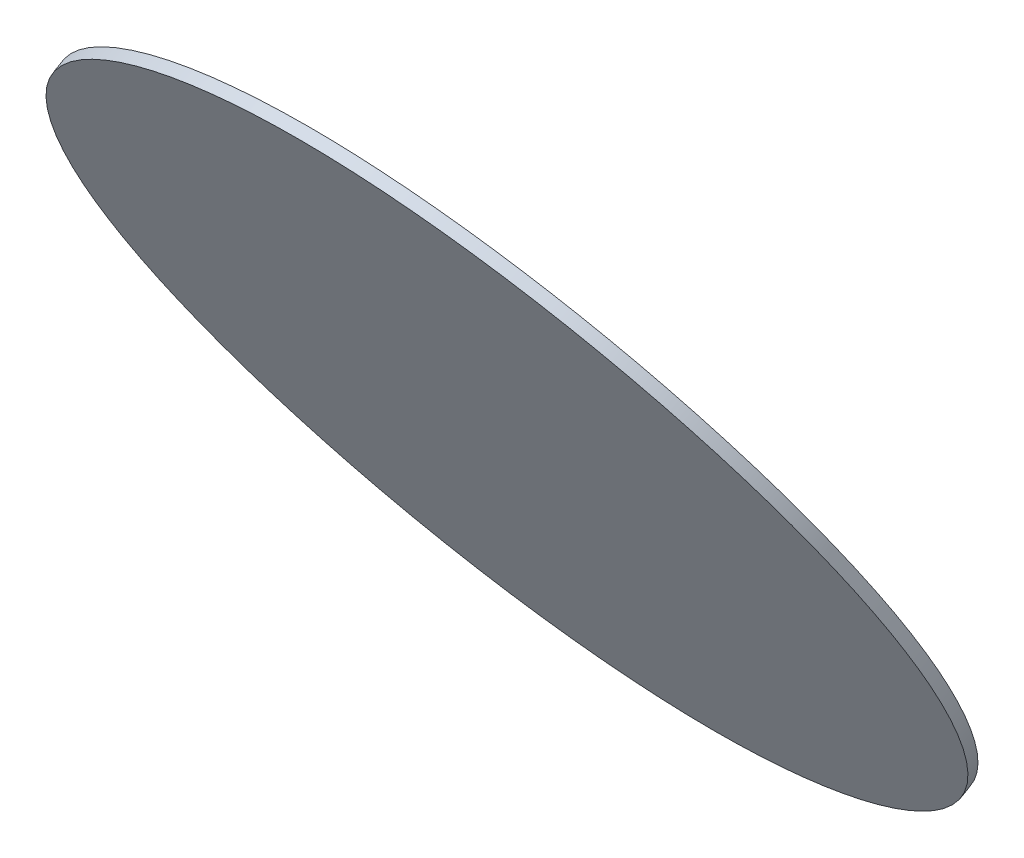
ISO-10303-21;
HEADER;
FILE_DESCRIPTION(('STEP AP214'),'2;1');
FILE_NAME('part.step','',(''),(''),'','','');
FILE_SCHEMA(('AUTOMOTIVE_DESIGN { 1 0 10303 214 1 1 1 1 }'));
ENDSEC;
DATA;
#1=APPLICATION_CONTEXT('core data for automotive mechanical design processes');
#2=APPLICATION_PROTOCOL_DEFINITION('international standard','automotive_design',2000,#1);
#3=PRODUCT_CONTEXT('',#1,'mechanical');
#4=PRODUCT('Part','Part','',(#3));
#5=PRODUCT_RELATED_PRODUCT_CATEGORY('part','',(#4));
#6=PRODUCT_DEFINITION_FORMATION('','',#4);
#7=PRODUCT_DEFINITION_CONTEXT('part definition',#1,'design');
#8=PRODUCT_DEFINITION('design','',#6,#7);
#9=PRODUCT_DEFINITION_SHAPE('','',#8);
#10=(LENGTH_UNIT() NAMED_UNIT(*) SI_UNIT(.MILLI.,.METRE.));
#11=(NAMED_UNIT(*) PLANE_ANGLE_UNIT() SI_UNIT($,.RADIAN.));
#12=(NAMED_UNIT(*) SI_UNIT($,.STERADIAN.) SOLID_ANGLE_UNIT());
#13=UNCERTAINTY_MEASURE_WITH_UNIT(LENGTH_MEASURE(1.E-05),#10,'distance_accuracy_value','');
#14=(GEOMETRIC_REPRESENTATION_CONTEXT(3) GLOBAL_UNCERTAINTY_ASSIGNED_CONTEXT((#13)) GLOBAL_UNIT_ASSIGNED_CONTEXT((#10,
#11,#12)) REPRESENTATION_CONTEXT('',''));
#15=CARTESIAN_POINT('',(0.,0.,0.));
#16=DIRECTION('',(0.,0.,1.));
#17=DIRECTION('',(1.,0.,0.));
#18=AXIS2_PLACEMENT_3D('',#15,#16,#17);
#19=CARTESIAN_POINT('',(-8.17414647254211E-09,26.6680644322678,25.787964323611));
#20=CARTESIAN_POINT('',(-2.08226279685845,26.6683910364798,25.7881528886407));
#21=CARTESIAN_POINT('',(-6.23428150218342,26.3082143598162,25.5802047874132));
#22=CARTESIAN_POINT('',(-12.227366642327,24.7723286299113,24.6934607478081));
#23=CARTESIAN_POINT('',(-17.8169278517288,22.3618821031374,23.301788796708));
#24=CARTESIAN_POINT('',(-22.8866628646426,19.1878807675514,21.4692782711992));
#25=CARTESIAN_POINT('',(-27.319279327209,15.35615582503,19.2570308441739));
#26=CARTESIAN_POINT('',(-30.9945407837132,10.969257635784,16.7242539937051));
#27=CARTESIAN_POINT('',(-33.7883174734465,6.12721648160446,13.9287002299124));
#28=CARTESIAN_POINT('',(-35.5706140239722,0.929267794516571,10.9276631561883));
#29=CARTESIAN_POINT('',(-36.1993788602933,-4.48258185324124,7.80313030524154));
#30=CARTESIAN_POINT('',(-35.5754985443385,-9.89578547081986,4.67781573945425));
#31=CARTESIAN_POINT('',(-33.7935445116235,-15.0963499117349,1.67526845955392));
#32=CARTESIAN_POINT('',(-30.9984057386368,-19.9419825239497,-1.12235883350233));
#33=CARTESIAN_POINT('',(-27.3208649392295,-24.3331863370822,-3.65762153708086));
#34=CARTESIAN_POINT('',(-22.8862683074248,-28.1696493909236,-5.87260451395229));
#35=CARTESIAN_POINT('',(-17.8158973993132,-31.3485354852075,-7.70793525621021));
#36=CARTESIAN_POINT('',(-12.2280640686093,-33.7636357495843,-9.10229404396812));
#37=CARTESIAN_POINT('',(-6.24001970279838,-35.3038642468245,-9.99154538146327));
#38=CARTESIAN_POINT('',(-0.0129368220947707,-35.8473871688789,-10.3053484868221));
#39=CARTESIAN_POINT('',(6.21430999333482,-35.3072480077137,-9.99349899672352));
#40=CARTESIAN_POINT('',(12.2024289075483,-33.7693823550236,-9.10561184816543));
#41=CARTESIAN_POINT('',(17.7904902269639,-31.3566250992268,-7.71260579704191));
#42=CARTESIAN_POINT('',(22.8615880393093,-28.1805374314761,-5.87889072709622));
#43=CARTESIAN_POINT('',(27.2977773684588,-24.3479065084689,-3.66612023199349));
#44=CARTESIAN_POINT('',(30.9781281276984,-19.9620975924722,-1.13397227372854));
#45=CARTESIAN_POINT('',(33.7777710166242,-15.1239325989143,1.65934358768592));
#46=CARTESIAN_POINT('',(35.5660713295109,-9.93336440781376,4.65611953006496));
#47=CARTESIAN_POINT('',(36.1997536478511,-4.53073686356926,7.7753279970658));
#48=CARTESIAN_POINT('',(35.5780125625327,0.873950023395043,10.8957254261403));
#49=CARTESIAN_POINT('',(33.7989997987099,6.06980786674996,13.8955553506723));
#50=CARTESIAN_POINT('',(31.0064459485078,10.9157216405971,16.6933449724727));
#51=CARTESIAN_POINT('',(27.3306578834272,15.3108875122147,19.2308951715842));
#52=CARTESIAN_POINT('',(22.8963726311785,19.153608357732,21.4494910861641));
#53=CARTESIAN_POINT('',(17.8243164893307,22.3396409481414,23.2889478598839));
#54=CARTESIAN_POINT('',(12.2322316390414,24.7612024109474,24.6870370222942));
#55=CARTESIAN_POINT('',(6.23682360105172,26.3060056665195,25.5789295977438));
#56=CARTESIAN_POINT('',(2.08269263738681,26.6677377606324,25.7877757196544));
#57=CARTESIAN_POINT('',(-8.17414647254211E-09,26.6680644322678,25.787964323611));
#58=B_SPLINE_CURVE_WITH_KNOTS('',3,(#19,#20,#21,#22,#23,#24,#25,#26,#27,#28,#29,#30,#31,#32,#33,
#34,#35,#36,#37,#38,#39,#40,#41,#42,#43,#44,#45,#46,#47,#48,#49,#50,#51,#52,#53,#54,#55,#56,
#57),.UNSPECIFIED.,.T.,.F.,(4,1,1,1,1,1,1,1,1,1,1,1,1,1,1,1,1,1,1,1,1,1,1,1,1,1,1,1,1,1,1,1,1,1,
1,1,4),(0.,0.027822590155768,0.0554784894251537,0.0831827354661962,0.11098372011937,
0.138830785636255,0.166641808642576,0.194369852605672,0.222070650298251,0.249969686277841,
0.277871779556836,0.305584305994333,0.333332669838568,0.361169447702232,0.389042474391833,
0.416863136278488,0.444573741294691,0.472215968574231,0.499999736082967,0.527781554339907,
0.555419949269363,0.583126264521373,0.610941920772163,0.63880745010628,0.666631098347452,
0.694356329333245,0.722030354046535,0.749872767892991,0.777720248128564,0.805408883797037,
0.833156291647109,0.861007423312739,0.888903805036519,0.916752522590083,0.944494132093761,
0.972171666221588,1.),.UNSPECIFIED.);
#59=DIRECTION('',(0.,-0.500000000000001,0.866025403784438));
#60=VECTOR('',#59,1.);
#61=SURFACE_OF_LINEAR_EXTRUSION('',#58,#60);
#62=CARTESIAN_POINT('',(2.33694887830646E-08,26.6680644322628,25.7879643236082));
#63=CARTESIAN_POINT('',(-0.467769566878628,26.6681377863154,25.7880066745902));
#64=CARTESIAN_POINT('',(-0.935524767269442,26.6590790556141,25.7827766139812));
#65=CARTESIAN_POINT('',(-1.87015053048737,26.6230155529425,25.7619553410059));
#66=CARTESIAN_POINT('',(-2.33702102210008,26.5960093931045,25.7463633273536));
#67=CARTESIAN_POINT('',(-3.26898583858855,26.5243664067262,25.7050002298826));
#68=CARTESIAN_POINT('',(-3.73408001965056,26.4797281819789,25.6792283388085));
#69=CARTESIAN_POINT('',(-4.66161379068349,26.373140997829,25.6176901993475));
#70=CARTESIAN_POINT('',(-5.12405337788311,26.3111920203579,25.5819239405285));
#71=CARTESIAN_POINT('',(-6.04539567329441,26.170277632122,25.5005669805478));
#72=CARTESIAN_POINT('',(-6.50429884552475,26.0913144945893,25.4549775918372));
#73=CARTESIAN_POINT('',(-7.41780590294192,25.9167632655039,25.3542003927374));
#74=CARTESIAN_POINT('',(-7.87241030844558,25.8211772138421,25.2990137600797));
#75=CARTESIAN_POINT('',(-8.77666909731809,25.6138539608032,25.1793156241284));
#76=CARTESIAN_POINT('',(-9.22632355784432,25.5021170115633,25.1148042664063));
#77=CARTESIAN_POINT('',(-10.1200300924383,25.2629438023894,24.9767175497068));
#78=CARTESIAN_POINT('',(-10.5640821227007,25.1355074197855,24.9031421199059));
#79=CARTESIAN_POINT('',(-11.445931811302,24.8653896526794,24.7471895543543));
#80=CARTESIAN_POINT('',(-11.8837297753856,24.7227090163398,24.6648128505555));
#81=CARTESIAN_POINT('',(-12.7524520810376,24.4225489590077,24.4915153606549));
#82=CARTESIAN_POINT('',(-13.1833771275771,24.2650710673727,24.400595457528));
#83=CARTESIAN_POINT('',(-14.0378495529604,23.9357879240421,24.2104837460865));
#84=CARTESIAN_POINT('',(-14.4613971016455,23.7639830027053,24.1112921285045));
#85=CARTESIAN_POINT('',(-15.3006252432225,23.4065083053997,23.9049040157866));
#86=CARTESIAN_POINT('',(-15.716305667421,23.220838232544,23.797707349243));
#87=CARTESIAN_POINT('',(-16.5393098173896,22.8360953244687,23.5755759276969));
#88=CARTESIAN_POINT('',(-16.9466335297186,22.6370224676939,23.4606411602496));
#89=CARTESIAN_POINT('',(-17.7524394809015,22.2259335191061,23.2232988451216));
#90=CARTESIAN_POINT('',(-18.1509222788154,22.0139182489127,23.1008917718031));
#91=CARTESIAN_POINT('',(-18.9386057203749,21.5773683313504,22.8488495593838));
#92=CARTESIAN_POINT('',(-19.3278068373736,21.352834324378,22.719214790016));
#93=CARTESIAN_POINT('',(-20.0965153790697,20.8916531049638,22.4529516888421));
#94=CARTESIAN_POINT('',(-20.4760228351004,20.6550059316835,22.3163233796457));
#95=CARTESIAN_POINT('',(-21.2249327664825,20.1700041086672,22.0363074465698));
#96=CARTESIAN_POINT('',(-21.5943351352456,19.9216493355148,21.8929197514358));
#97=CARTESIAN_POINT('',(-22.3226250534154,19.4136393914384,21.5996200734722));
#98=CARTESIAN_POINT('',(-22.6815126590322,19.1539842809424,21.4497081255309));
#99=CARTESIAN_POINT('',(-23.3883632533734,18.623766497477,21.143586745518));
#100=CARTESIAN_POINT('',(-23.736326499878,18.3532040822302,20.9873774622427));
#101=CARTESIAN_POINT('',(-24.4209074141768,17.8015274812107,20.6688668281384));
#102=CARTESIAN_POINT('',(-24.7575252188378,17.5204134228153,20.5065655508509));
#103=CARTESIAN_POINT('',(-25.4189998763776,16.947992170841,20.1760779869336));
#104=CARTESIAN_POINT('',(-25.7438567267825,16.656684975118,20.0078916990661));
#105=CARTESIAN_POINT('',(-26.3813919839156,16.064234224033,19.6658400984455));
#106=CARTESIAN_POINT('',(-26.6940702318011,15.76309054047,19.4919747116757));
#107=CARTESIAN_POINT('',(-27.3068335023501,15.1513284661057,19.1387737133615));
#108=CARTESIAN_POINT('',(-27.6069182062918,14.8407098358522,18.9594379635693));
#109=CARTESIAN_POINT('',(-28.1940347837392,14.2103501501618,18.5954996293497));
#110=CARTESIAN_POINT('',(-28.4810665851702,13.890609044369,18.4108970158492));
#111=CARTESIAN_POINT('',(-29.0416027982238,13.2423577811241,18.0366289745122));
#112=CARTESIAN_POINT('',(-29.3151073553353,12.9138477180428,17.8469636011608));
#113=CARTESIAN_POINT('',(-29.8481166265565,12.2484134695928,17.4627749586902));
#114=CARTESIAN_POINT('',(-30.107621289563,11.9114892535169,17.2682516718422));
#115=CARTESIAN_POINT('',(-30.6121586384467,11.2295824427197,16.8745525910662));
#116=CARTESIAN_POINT('',(-30.8571905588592,10.8845994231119,16.6753765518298));
#117=CARTESIAN_POINT('',(-31.332288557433,10.1869574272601,16.2725927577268));
#118=CARTESIAN_POINT('',(-31.56235369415,9.83429797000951,16.0689847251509));
#119=CARTESIAN_POINT('',(-32.00698436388,9.12172343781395,15.6575796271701));
#120=CARTESIAN_POINT('',(-32.2215499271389,8.76180837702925,15.4497825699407));
#121=CARTESIAN_POINT('',(-32.6346460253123,8.03514734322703,15.0302446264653));
#122=CARTESIAN_POINT('',(-32.8331768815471,7.66840150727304,14.8185038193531));
#123=CARTESIAN_POINT('',(-33.2136697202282,6.92850409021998,14.3913238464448));
#124=CARTESIAN_POINT('',(-33.3956312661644,6.55535234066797,14.1758845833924));
#125=CARTESIAN_POINT('',(-33.7424426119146,5.80308280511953,13.7415615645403));
#126=CARTESIAN_POINT('',(-33.9072906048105,5.42396439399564,13.5226774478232));
#127=CARTESIAN_POINT('',(-34.2193604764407,4.66030169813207,13.0817765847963));
#128=CARTESIAN_POINT('',(-34.3665815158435,4.27575715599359,12.8597596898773));
#129=CARTESIAN_POINT('',(-34.6428729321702,3.50180869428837,12.4129203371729));
#130=CARTESIAN_POINT('',(-34.7719434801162,3.11240482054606,12.1880979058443));
#131=CARTESIAN_POINT('',(-35.0114161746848,2.32930557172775,11.7359753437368));
#132=CARTESIAN_POINT('',(-35.1218180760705,1.93561014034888,11.5086751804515));
#133=CARTESIAN_POINT('',(-35.323410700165,1.14449444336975,11.0519243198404));
#134=CARTESIAN_POINT('',(-35.4145991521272,0.747073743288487,10.822473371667));
#135=CARTESIAN_POINT('',(-35.5773282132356,-0.0508285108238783,10.3618042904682));
#136=CARTESIAN_POINT('',(-35.6488662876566,-0.451310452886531,10.1305859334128));
#137=CARTESIAN_POINT('',(-35.771973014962,-1.25457333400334,9.66682189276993));
#138=CARTESIAN_POINT('',(-35.8235416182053,-1.65735427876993,9.43427620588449));
#139=CARTESIAN_POINT('',(-35.9063586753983,-2.46445379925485,8.9682970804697));
#140=CARTESIAN_POINT('',(-35.937608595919,-2.8687722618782,8.73486370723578));
#141=CARTESIAN_POINT('',(-35.9794457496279,-3.67818567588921,8.26754865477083));
#142=CARTESIAN_POINT('',(-35.9900344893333,-4.08328056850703,8.03366700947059));
#143=CARTESIAN_POINT('',(-35.9902090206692,-4.89347588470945,7.56590052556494));
#144=CARTESIAN_POINT('',(-35.9797947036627,-5.29857630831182,7.33201568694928));
#145=CARTESIAN_POINT('',(-35.93829728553,-6.1080087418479,6.86468965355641));
#146=CARTESIAN_POINT('',(-35.9072125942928,-6.51234069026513,6.63124849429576));
#147=CARTESIAN_POINT('',(-35.8247018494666,-7.31947027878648,6.16525200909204));
#148=CARTESIAN_POINT('',(-35.7732743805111,-7.722267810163,5.93269674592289));
#149=CARTESIAN_POINT('',(-35.6504132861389,-8.5255623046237,5.46891445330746));
#150=CARTESIAN_POINT('',(-35.5789798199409,-8.92605928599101,5.23768741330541));
#151=CARTESIAN_POINT('',(-35.4164066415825,-9.72398490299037,4.77700484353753));
#152=CARTESIAN_POINT('',(-35.3252695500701,-10.1214139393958,4.54754908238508));
#153=CARTESIAN_POINT('',(-35.1237300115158,-10.9125388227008,4.09079291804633));
#154=CARTESIAN_POINT('',(-35.0133297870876,-11.3062350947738,3.86349226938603));
#155=CARTESIAN_POINT('',(-34.7738268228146,-12.0893298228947,3.41137231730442));
#156=CARTESIAN_POINT('',(-34.644724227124,-12.4787283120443,3.1865529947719));
#157=CARTESIAN_POINT('',(-34.3683480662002,-13.2526604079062,2.73972309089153));
#158=CARTESIAN_POINT('',(-34.2210742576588,-13.6371939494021,2.51771254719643));
#159=CARTESIAN_POINT('',(-33.9088919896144,-14.4008297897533,2.07682718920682));
#160=CARTESIAN_POINT('',(-33.743984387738,-14.7799323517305,1.8579522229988));
#161=CARTESIAN_POINT('',(-33.3970593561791,-15.5321676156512,1.42364899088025));
#162=CARTESIAN_POINT('',(-33.2150438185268,-15.9053009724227,1.2082203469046));
#163=CARTESIAN_POINT('',(-32.8344516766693,-16.6451616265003,0.781061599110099));
#164=CARTESIAN_POINT('',(-32.635875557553,-17.0118891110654,0.56933138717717));
#165=CARTESIAN_POINT('',(-32.2227010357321,-17.7385163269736,0.149812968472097));
#166=CARTESIAN_POINT('',(-32.0081023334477,-18.0984159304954,-0.0579751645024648));
#167=CARTESIAN_POINT('',(-31.5634207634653,-18.8109652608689,-0.469365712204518));
#168=CARTESIAN_POINT('',(-31.3333378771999,-19.1636149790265,-0.672968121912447));
#169=CARTESIAN_POINT('',(-30.8582230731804,-19.8612462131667,-1.07574570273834));
#170=CARTESIAN_POINT('',(-30.6131921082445,-20.2062282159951,-1.2749211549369));
#171=CARTESIAN_POINT('',(-30.1086774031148,-20.8881450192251,-1.66862600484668));
#172=CARTESIAN_POINT('',(-29.8491944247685,-21.2250802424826,-1.86315564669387));
#173=CARTESIAN_POINT('',(-29.3162509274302,-21.890551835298,-2.24736584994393));
#174=CARTESIAN_POINT('',(-29.0427904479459,-22.2190882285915,-2.4370464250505));
#175=CARTESIAN_POINT('',(-28.4823664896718,-22.8674107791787,-2.81135562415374));
#176=CARTESIAN_POINT('',(-28.195402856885,-23.1871968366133,-2.99598419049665));
#177=CARTESIAN_POINT('',(-27.6084485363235,-23.8176684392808,-3.35998714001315));
#178=CARTESIAN_POINT('',(-27.3084579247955,-24.1283540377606,-3.53936155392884));
#179=CARTESIAN_POINT('',(-26.6959096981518,-24.7402753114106,-3.8926544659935));
#180=CARTESIAN_POINT('',(-26.3833524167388,-25.0415112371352,-4.06657310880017));
#181=CARTESIAN_POINT('',(-25.7460839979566,-25.6341737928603,-4.40874699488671));
#182=CARTESIAN_POINT('',(-25.4213730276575,-25.9256005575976,-4.57700231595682));
#183=CARTESIAN_POINT('',(-24.7602133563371,-26.4982906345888,-4.90764508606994));
#184=CARTESIAN_POINT('',(-24.4237646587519,-26.7795539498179,-5.0700325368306));
#185=CARTESIAN_POINT('',(-23.7395433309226,-27.3315609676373,-5.38873393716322));
#186=CARTESIAN_POINT('',(-23.3917705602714,-27.602304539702,-5.54504781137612));
#187=CARTESIAN_POINT('',(-22.6853207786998,-28.1329191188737,-5.85139828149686));
#188=CARTESIAN_POINT('',(-22.3266435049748,-28.3927898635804,-6.00143472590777));
#189=CARTESIAN_POINT('',(-21.5987906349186,-28.9012658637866,-6.29500348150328));
#190=CARTESIAN_POINT('',(-21.2296149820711,-29.1498710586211,-6.43853575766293));
#191=CARTESIAN_POINT('',(-20.481170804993,-29.6354078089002,-6.71886053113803));
#192=CARTESIAN_POINT('',(-20.1019023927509,-29.8723394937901,-6.85565310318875));
#193=CARTESIAN_POINT('',(-19.333680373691,-30.3341232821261,-7.12226409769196));
#194=CARTESIAN_POINT('',(-18.944726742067,-30.5589753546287,-7.25208250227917));
#195=CARTESIAN_POINT('',(-18.1575428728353,-30.9961945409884,-7.50451111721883));
#196=CARTESIAN_POINT('',(-17.7593121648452,-31.2085610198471,-7.62712096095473));
#197=CARTESIAN_POINT('',(-16.9540105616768,-31.6203844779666,-7.86488734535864));
#198=CARTESIAN_POINT('',(-16.546939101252,-31.8198406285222,-7.98004340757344));
#199=CARTESIAN_POINT('',(-15.7244345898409,-32.2053785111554,-8.20263380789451));
#200=CARTESIAN_POINT('',(-15.3090015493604,-32.3914602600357,-8.31006815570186));
#201=CARTESIAN_POINT('',(-14.4702587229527,-32.7497832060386,-8.51694600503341));
#202=CARTESIAN_POINT('',(-14.046949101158,-32.922024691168,-8.61638967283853));
#203=CARTESIAN_POINT('',(-13.192938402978,-33.2522021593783,-8.80701772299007));
#204=CARTESIAN_POINT('',(-12.7622371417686,-33.4101377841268,-8.89820189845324));
#205=CARTESIAN_POINT('',(-11.8939439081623,-33.7112313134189,-9.07203832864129));
#206=CARTESIAN_POINT('',(-11.4563512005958,-33.8543876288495,-9.15468966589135));
#207=CARTESIAN_POINT('',(-10.5748886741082,-34.1254619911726,-9.31119452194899));
#208=CARTESIAN_POINT('',(-10.1310185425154,-34.2533792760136,-9.38504760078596));
#209=CARTESIAN_POINT('',(-9.2376494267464,-34.4935051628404,-9.52368434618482));
#210=CARTESIAN_POINT('',(-8.78815050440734,-34.6057139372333,-9.58846811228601));
#211=CARTESIAN_POINT('',(-7.88417359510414,-34.8139579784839,-9.70869786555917));
#212=CARTESIAN_POINT('',(-7.42969554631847,-34.9099930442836,-9.76414373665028));
#213=CARTESIAN_POINT('',(-6.516408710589,-35.0854042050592,-9.86541741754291));
#214=CARTESIAN_POINT('',(-6.05759939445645,-35.1647782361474,-9.91124403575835));
#215=CARTESIAN_POINT('',(-5.13641307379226,-35.3064670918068,-9.99304813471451));
#216=CARTESIAN_POINT('',(-4.67403558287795,-35.3687795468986,-10.0290242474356));
#217=CARTESIAN_POINT('',(-3.74660003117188,-35.4760473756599,-10.0909553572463));
#218=CARTESIAN_POINT('',(-3.28154196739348,-35.5210027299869,-10.1169103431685));
#219=CARTESIAN_POINT('',(-2.34963272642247,-35.5932325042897,-10.1586122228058));
#220=CARTESIAN_POINT('',(-1.88278169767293,-35.6205083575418,-10.1743599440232));
#221=CARTESIAN_POINT('',(-0.94817363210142,-35.6570631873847,-10.1954648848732));
#222=CARTESIAN_POINT('',(-0.480416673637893,-35.6663436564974,-10.2008229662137));
#223=CARTESIAN_POINT('',(0.455104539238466,-35.666591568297,-10.2009660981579));
#224=CARTESIAN_POINT('',(0.922868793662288,-35.6575589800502,-10.1957511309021));
#225=CARTESIAN_POINT('',(1.85750447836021,-35.6214951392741,-10.174929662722));
#226=CARTESIAN_POINT('',(2.32437583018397,-35.5944623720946,-10.159322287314));
#227=CARTESIAN_POINT('',(3.25633647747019,-35.5227089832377,-10.1178954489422));
#228=CARTESIAN_POINT('',(3.72142562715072,-35.47798694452,-10.0920751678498));
#229=CARTESIAN_POINT('',(4.64893191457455,-35.3711712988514,-10.0304051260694));
#230=CARTESIAN_POINT('',(5.11134905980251,-35.3090777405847,-9.99455539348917));
#231=CARTESIAN_POINT('',(6.03262080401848,-35.1678064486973,-9.91299237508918));
#232=CARTESIAN_POINT('',(6.49147589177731,-35.088631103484,-9.86728046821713));
#233=CARTESIAN_POINT('',(7.40485908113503,-34.9135971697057,-9.7662245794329));
#234=CARTESIAN_POINT('',(7.8593877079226,-34.8177406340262,-9.71088178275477));
#235=CARTESIAN_POINT('',(8.76347039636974,-34.6098379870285,-9.5908491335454));
#236=CARTESIAN_POINT('',(9.21302451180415,-34.4977920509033,-9.5261593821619));
#237=CARTESIAN_POINT('',(10.1065082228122,-34.2579796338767,-9.38770361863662));
#238=CARTESIAN_POINT('',(10.5504377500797,-34.130212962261,-9.31393749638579));
#239=CARTESIAN_POINT('',(11.4320229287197,-33.8594313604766,-9.15760166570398));
#240=CARTESIAN_POINT('',(11.8696788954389,-33.7164171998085,-9.07503240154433));
#241=CARTESIAN_POINT('',(12.7381026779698,-33.4156028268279,-8.90135714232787));
#242=CARTESIAN_POINT('',(13.1688712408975,-33.2578042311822,-8.81025208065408));
#243=CARTESIAN_POINT('',(14.0230214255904,-32.9278972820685,-8.61978021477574));
#244=CARTESIAN_POINT('',(14.4464032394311,-32.7557893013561,-8.52041362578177));
#245=CARTESIAN_POINT('',(15.2852963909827,-32.3977314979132,-8.31368885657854));
#246=CARTESIAN_POINT('',(15.7008075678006,-32.2117813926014,-8.20633051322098));
#247=CARTESIAN_POINT('',(16.5234753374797,-31.8265065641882,-7.98389198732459));
#248=CARTESIAN_POINT('',(16.9306319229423,-31.627181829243,-7.86881179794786));
#249=CARTESIAN_POINT('',(17.7361118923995,-31.215622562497,-7.63119794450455));
#250=CARTESIAN_POINT('',(18.1344358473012,-31.0033888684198,-7.50866476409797));
#251=CARTESIAN_POINT('',(18.9218159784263,-30.5664378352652,-7.25639096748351));
#252=CARTESIAN_POINT('',(19.3108726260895,-30.3417211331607,-7.12665071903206));
#253=CARTESIAN_POINT('',(20.0793123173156,-29.8802118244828,-6.86019819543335));
#254=CARTESIAN_POINT('',(20.458695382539,-29.6434192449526,-6.72348593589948));
#255=CARTESIAN_POINT('',(21.2073823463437,-29.1581655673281,-6.44332459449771));
#256=CARTESIAN_POINT('',(21.5766861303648,-28.9097043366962,-6.29987543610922));
#257=CARTESIAN_POINT('',(22.3048106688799,-28.4015223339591,-6.0064764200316));
#258=CARTESIAN_POINT('',(22.6636314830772,-28.1418016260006,-5.85652659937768));
#259=CARTESIAN_POINT('',(23.3703855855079,-27.6114938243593,-5.55035324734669));
#260=CARTESIAN_POINT('',(23.7183191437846,-27.3409070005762,-5.39412987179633));
#261=CARTESIAN_POINT('',(24.4028807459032,-26.7892197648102,-5.07561309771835));
#262=CARTESIAN_POINT('',(24.7395089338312,-26.508119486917,-4.91331977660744));
#263=CARTESIAN_POINT('',(25.4010479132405,-25.9357614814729,-4.58286872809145));
#264=CARTESIAN_POINT('',(25.7259587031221,-25.6445037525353,-4.41471099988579));
#265=CARTESIAN_POINT('',(26.3636486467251,-25.052184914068,-4.07273555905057));
#266=CARTESIAN_POINT('',(26.6764276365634,-24.7511236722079,-3.89891777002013));
#267=CARTESIAN_POINT('',(27.2894428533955,-24.1395571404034,-3.5458296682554));
#268=CARTESIAN_POINT('',(27.5896787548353,-23.8290516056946,-3.36655921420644));
#269=CARTESIAN_POINT('',(28.1771477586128,-23.198943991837,-3.00276641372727));
#270=CARTESIAN_POINT('',(28.4643807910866,-22.8793418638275,-2.81824403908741));
#271=CARTESIAN_POINT('',(29.025368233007,-22.2313892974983,-2.44414845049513));
#272=CARTESIAN_POINT('',(29.2991227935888,-21.9030389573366,-2.25457529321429));
#273=CARTESIAN_POINT('',(29.8326796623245,-21.2379398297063,-1.87058013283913));
#274=CARTESIAN_POINT('',(30.0924819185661,-20.9011910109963,-1.67615811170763));
#275=CARTESIAN_POINT('',(30.5976612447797,-20.2196458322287,-1.28266781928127));
#276=CARTESIAN_POINT('',(30.843037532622,-19.8748490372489,-1.08359929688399));
#277=CARTESIAN_POINT('',(31.3188679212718,-19.1775852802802,-0.681033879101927));
#278=CARTESIAN_POINT('',(31.5493210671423,-18.8251178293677,-0.477536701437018));
#279=CARTESIAN_POINT('',(31.9947636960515,-18.1129271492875,-0.0663532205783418));
#280=CARTESIAN_POINT('',(32.2097532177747,-17.7532039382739,0.141333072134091));
#281=CARTESIAN_POINT('',(32.623726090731,-17.0269209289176,0.560652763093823));
#282=CARTESIAN_POINT('',(32.8227097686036,-16.6603612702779,0.772286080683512));
#283=CARTESIAN_POINT('',(33.2041297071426,-15.9208248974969,1.19925760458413));
#284=CARTESIAN_POINT('',(33.3865655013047,-15.5478480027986,1.4145959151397));
#285=CARTESIAN_POINT('',(33.7343398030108,-14.7959121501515,1.84872628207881));
#286=CARTESIAN_POINT('',(33.8996764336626,-14.4169525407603,2.06751871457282));
#287=CARTESIAN_POINT('',(34.2127215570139,-13.6535874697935,2.50824774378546));
#288=CARTESIAN_POINT('',(34.3604292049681,-13.2691817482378,2.73018449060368));
#289=CARTESIAN_POINT('',(34.6376737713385,-12.4954877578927,3.17687692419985));
#290=CARTESIAN_POINT('',(34.7672108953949,-12.1061995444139,3.40163257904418));
#291=CARTESIAN_POINT('',(35.0075791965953,-11.3233053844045,3.85363673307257));
#292=CARTESIAN_POINT('',(35.1184101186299,-10.9296993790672,4.08088526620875));
#293=CARTESIAN_POINT('',(35.3208048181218,-10.1387333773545,4.53754970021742));
#294=CARTESIAN_POINT('',(35.4123661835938,-9.74137291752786,4.76696586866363));
#295=CARTESIAN_POINT('',(35.5757705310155,-8.94356505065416,5.22758045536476));
#296=CARTESIAN_POINT('',(35.6476108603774,-8.54311723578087,5.45877910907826));
#297=CARTESIAN_POINT('',(35.77123709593,-7.73990373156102,5.92251464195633));
#298=CARTESIAN_POINT('',(35.8230229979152,-7.33713804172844,6.15505152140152));
#299=CARTESIAN_POINT('',(35.9061753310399,-6.53005740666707,6.62101974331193));
#300=CARTESIAN_POINT('',(35.9375433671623,-6.12574258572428,6.85445101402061));
#301=CARTESIAN_POINT('',(35.9795008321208,-5.31633198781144,7.32176444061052));
#302=CARTESIAN_POINT('',(35.9900919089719,-4.91123627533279,7.55564655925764));
#303=CARTESIAN_POINT('',(35.9901480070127,-4.10104234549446,8.02341224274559));
#304=CARTESIAN_POINT('',(35.9796129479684,-3.69594412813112,8.25729580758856));
#305=CARTESIAN_POINT('',(35.9377804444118,-2.88652437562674,8.72461451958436));
#306=CARTESIAN_POINT('',(35.9064812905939,-2.4822029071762,8.95804962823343));
#307=CARTESIAN_POINT('',(35.8234689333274,-1.67510696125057,9.42402668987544));
#308=CARTESIAN_POINT('',(35.771754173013,-1.27233260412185,9.65656857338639));
#309=CARTESIAN_POINT('',(35.6482685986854,-0.469101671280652,10.1203141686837));
#310=CARTESIAN_POINT('',(35.5764979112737,-0.0686450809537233,10.3515178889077));
#311=CARTESIAN_POINT('',(35.4132232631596,0.729178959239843,10.8121418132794));
#312=CARTESIAN_POINT('',(35.321722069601,1.12654683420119,11.0415622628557));
#313=CARTESIAN_POINT('',(35.1194478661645,1.91753210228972,11.4982378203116));
#314=CARTESIAN_POINT('',(35.0086771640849,2.3111499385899,11.7254931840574));
#315=CARTESIAN_POINT('',(34.7684331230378,3.09407292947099,12.1775139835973));
#316=CARTESIAN_POINT('',(34.6389599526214,3.48337812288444,12.4022794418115));
#317=CARTESIAN_POINT('',(34.361851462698,4.25711129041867,12.8489944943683));
#318=CARTESIAN_POINT('',(34.2142159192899,4.64153920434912,13.0709440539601));
#319=CARTESIAN_POINT('',(33.9013268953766,5.4049537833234,13.5117016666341));
#320=CARTESIAN_POINT('',(33.7360743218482,5.78394072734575,13.7305098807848));
#321=CARTESIAN_POINT('',(33.3884841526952,6.53594010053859,14.1646769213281));
#322=CARTESIAN_POINT('',(33.2061484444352,6.90895318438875,14.3800361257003));
#323=CARTESIAN_POINT('',(32.8249437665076,7.64857287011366,14.8070557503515));
#324=CARTESIAN_POINT('',(32.6260752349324,8.01517964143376,15.0187162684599));
#325=CARTESIAN_POINT('',(32.2123466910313,8.74156784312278,15.4380966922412));
#326=CARTESIAN_POINT('',(31.9974863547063,9.10134913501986,15.6458165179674));
#327=CARTESIAN_POINT('',(31.5523152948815,9.81366706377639,16.0570734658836));
#328=CARTESIAN_POINT('',(31.3220045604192,10.1662036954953,16.2606105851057));
#329=CARTESIAN_POINT('',(30.8464708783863,10.8636175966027,16.6632626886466));
#330=CARTESIAN_POINT('',(30.6012489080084,11.208495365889,16.8623779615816));
#331=CARTESIAN_POINT('',(30.0963872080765,11.890215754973,17.2559694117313));
#332=CARTESIAN_POINT('',(29.8367482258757,12.227058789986,17.4504458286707));
#333=CARTESIAN_POINT('',(29.3035256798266,12.8923594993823,17.8345573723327));
#334=CARTESIAN_POINT('',(29.0299421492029,13.2208171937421,18.0241925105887));
#335=CARTESIAN_POINT('',(28.4693032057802,13.8689972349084,18.3984194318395));
#336=CARTESIAN_POINT('',(28.1822476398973,14.188719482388,18.5830111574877));
#337=CARTESIAN_POINT('',(27.5951390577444,14.8190800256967,18.9469499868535));
#338=CARTESIAN_POINT('',(27.2950861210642,15.1297183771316,19.1262971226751));
#339=CARTESIAN_POINT('',(26.682439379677,15.7415624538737,19.4795454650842));
#340=CARTESIAN_POINT('',(26.3698459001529,16.0427684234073,19.6534468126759));
#341=CARTESIAN_POINT('',(25.7325272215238,16.6353878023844,19.9955957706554));
#342=CARTESIAN_POINT('',(25.40780218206,16.9268013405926,20.1638434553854));
#343=CARTESIAN_POINT('',(24.7466331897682,17.4994812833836,20.4944803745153));
#344=CARTESIAN_POINT('',(24.4101892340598,17.7807476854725,20.6568696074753));
#345=CARTESIAN_POINT('',(23.7259927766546,18.3327766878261,20.9755837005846));
#346=CARTESIAN_POINT('',(23.3782401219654,18.603539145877,21.1319084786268));
#347=CARTESIAN_POINT('',(22.6718427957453,19.1342066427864,21.4382895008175));
#348=CARTESIAN_POINT('',(22.31319784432,19.3941114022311,21.5883455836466));
#349=CARTESIAN_POINT('',(21.5854179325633,19.902667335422,21.8819604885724));
#350=CARTESIAN_POINT('',(21.2162829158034,20.1513184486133,22.0255192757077));
#351=CARTESIAN_POINT('',(20.4679250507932,20.6369562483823,22.305902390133));
#352=CARTESIAN_POINT('',(20.0887023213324,20.8739430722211,22.4427267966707));
#353=CARTESIAN_POINT('',(19.3205733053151,21.3358435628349,22.7094051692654));
#354=CARTESIAN_POINT('',(18.9316669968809,21.56075720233,22.8392591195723));
#355=CARTESIAN_POINT('',(18.1445761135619,21.9981031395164,23.0917609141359));
#356=CARTESIAN_POINT('',(17.7463910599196,22.2105347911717,23.2144083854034));
#357=CARTESIAN_POINT('',(16.9411771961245,22.6224887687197,23.4522501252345));
#358=CARTESIAN_POINT('',(16.5341478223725,22.8220102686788,23.567443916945));
#359=CARTESIAN_POINT('',(15.7117225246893,23.2076768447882,23.7901086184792));
#360=CARTESIAN_POINT('',(15.2963266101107,23.3938219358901,23.8975795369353));
#361=CARTESIAN_POINT('',(14.4576513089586,23.7522675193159,24.104528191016));
#362=CARTESIAN_POINT('',(14.0343720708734,23.9245682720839,24.2040060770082));
#363=CARTESIAN_POINT('',(13.1804136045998,24.2548580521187,24.3946989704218));
#364=CARTESIAN_POINT('',(12.7497341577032,24.4128466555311,24.4859137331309));
#365=CARTESIAN_POINT('',(11.8814756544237,24.7140379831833,24.6598066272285));
#366=CARTESIAN_POINT('',(11.4438958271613,24.8572390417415,24.7424837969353));
#367=CARTESIAN_POINT('',(10.5624512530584,25.128387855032,24.899031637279));
#368=CARTESIAN_POINT('',(10.1185861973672,25.256334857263,24.9729018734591));
#369=CARTESIAN_POINT('',(9.22521995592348,25.4964968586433,25.1115594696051));
#370=CARTESIAN_POINT('',(8.77571885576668,25.6087120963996,25.1763469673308));
#371=CARTESIAN_POINT('',(7.87173116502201,25.8169387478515,25.2965666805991));
#372=CARTESIAN_POINT('',(7.41724453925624,25.9129500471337,25.3519988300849));
#373=CARTESIAN_POINT('',(6.50393432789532,26.0882727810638,25.4532214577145));
#374=CARTESIAN_POINT('',(6.04511023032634,26.1675822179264,25.4990107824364));
#375=CARTESIAN_POINT('',(5.12389155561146,26.309107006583,25.5807201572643));
#376=CARTESIAN_POINT('',(4.66149649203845,26.3713199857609,25.6166388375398));
#377=CARTESIAN_POINT('',(3.73402763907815,26.478377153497,25.6784483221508));
#378=CARTESIAN_POINT('',(3.2689538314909,26.5232212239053,25.7043390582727));
#379=CARTESIAN_POINT('',(2.33701486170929,26.5952364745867,25.7459170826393));
#380=CARTESIAN_POINT('',(1.87014983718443,26.622408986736,25.7616051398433));
#381=CARTESIAN_POINT('',(0.935528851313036,26.6587854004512,25.7826070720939));
#382=CARTESIAN_POINT('',(0.467772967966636,26.6679908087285,25.7879218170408));
#383=CARTESIAN_POINT('',(2.33694887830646E-08,26.6680644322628,25.7879643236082));
#384=B_SPLINE_CURVE_WITH_KNOTS('',3,(#62,#63,#64,#65,#66,#67,#68,#69,#70,#71,#72,#73,#74,#75,
#76,#77,#78,#79,#80,#81,#82,#83,#84,#85,#86,#87,#88,#89,#90,#91,#92,#93,#94,#95,#96,#97,#98,#99,
#100,#101,#102,#103,#104,#105,#106,#107,#108,#109,#110,#111,#112,#113,#114,#115,#116,#117,#118,
#119,#120,#121,#122,#123,#124,#125,#126,#127,#128,#129,#130,#131,#132,#133,#134,#135,#136,#137,
#138,#139,#140,#141,#142,#143,#144,#145,#146,#147,#148,#149,#150,#151,#152,#153,#154,#155,#156,
#157,#158,#159,#160,#161,#162,#163,#164,#165,#166,#167,#168,#169,#170,#171,#172,#173,#174,#175,
#176,#177,#178,#179,#180,#181,#182,#183,#184,#185,#186,#187,#188,#189,#190,#191,#192,#193,#194,
#195,#196,#197,#198,#199,#200,#201,#202,#203,#204,#205,#206,#207,#208,#209,#210,#211,#212,#213,
#214,#215,#216,#217,#218,#219,#220,#221,#222,#223,#224,#225,#226,#227,#228,#229,#230,#231,#232,
#233,#234,#235,#236,#237,#238,#239,#240,#241,#242,#243,#244,#245,#246,#247,#248,#249,#250,#251,
#252,#253,#254,#255,#256,#257,#258,#259,#260,#261,#262,#263,#264,#265,#266,#267,#268,#269,#270,
#271,#272,#273,#274,#275,#276,#277,#278,#279,#280,#281,#282,#283,#284,#285,#286,#287,#288,#289,
#290,#291,#292,#293,#294,#295,#296,#297,#298,#299,#300,#301,#302,#303,#304,#305,#306,#307,#308,
#309,#310,#311,#312,#313,#314,#315,#316,#317,#318,#319,#320,#321,#322,#323,#324,#325,#326,#327,
#328,#329,#330,#331,#332,#333,#334,#335,#336,#337,#338,#339,#340,#341,#342,#343,#344,#345,#346,
#347,#348,#349,#350,#351,#352,#353,#354,#355,#356,#357,#358,#359,#360,#361,#362,#363,#364,#365,
#366,#367,#368,#369,#370,#371,#372,#373,#374,#375,#376,#377,#378,#379,#380,#381,#382,#383),
.UNSPECIFIED.,.F.,.F.,(4,2,2,2,2,2,2,2,2,2,2,2,2,2,2,2,2,2,2,2,2,2,2,2,2,2,2,2,2,2,2,2,2,2,2,2,
2,2,2,2,2,2,2,2,2,2,2,2,2,2,2,2,2,2,2,2,2,2,2,2,2,2,2,2,2,2,2,2,2,2,2,2,2,2,2,2,2,2,2,2,2,2,2,2,
2,2,2,2,2,2,2,2,2,2,2,2,2,2,2,2,2,2,2,2,2,2,2,2,2,2,2,2,2,2,2,2,2,2,2,2,2,2,2,2,2,2,2,2,2,2,2,2,
2,2,2,2,2,2,2,2,2,2,2,2,2,2,2,2,2,2,2,2,2,2,2,2,2,2,2,2,4),(0.,1.40316642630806,
2.80644137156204,4.20982761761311,5.61321532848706,7.01641565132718,8.41944390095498,
9.82245024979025,11.2254675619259,12.6284160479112,14.0312196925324,15.433990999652,
16.8367923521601,18.2395959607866,19.6423106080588,21.044953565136,22.4475919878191,
23.8502451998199,25.252890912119,26.6555035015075,28.0580991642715,29.4606951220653,
30.8633093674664,32.2659590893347,33.6686165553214,35.0712589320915,36.4739064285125,
37.8766280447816,39.2794378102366,40.6822448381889,42.0850237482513,43.4878396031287,
44.8908034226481,46.2938340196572,47.6968513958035,49.0998872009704,50.5030887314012,
51.9064711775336,53.3098571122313,54.7131417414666,56.1163240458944,57.5195136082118,
58.9228111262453,60.3262062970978,61.729590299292,63.1327877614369,64.5358234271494,
65.9388482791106,67.3418919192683,68.7448673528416,70.1476878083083,71.550467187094,
72.9532728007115,74.3560800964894,75.7587980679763,77.1614421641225,78.5640822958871,
79.9667384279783,81.3693863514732,82.7719970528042,84.1745884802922,85.5771794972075,
86.9797879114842,88.3824301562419,89.7850799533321,91.1877141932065,92.5903520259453,
93.9930611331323,95.395860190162,96.7986574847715,98.2014255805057,99.604228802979,
101.007182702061,102.410206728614,103.813215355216,105.216241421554,106.619441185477,
108.022835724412,109.426231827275,110.829514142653,112.232680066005,113.635848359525,
115.039134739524,116.442533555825,117.845928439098,119.249127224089,120.652153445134,
122.055164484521,123.458192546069,124.861149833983,126.263953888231,127.666721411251,
129.069517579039,130.472314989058,131.87502146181,133.277656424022,134.680288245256,
136.082936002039,137.485575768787,138.888180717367,140.290767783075,141.693355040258,
143.095961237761,144.498603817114,145.901253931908,147.30388831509,148.706527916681,
150.109243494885,151.512048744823,152.914850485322,154.317623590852,155.720436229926,
157.123402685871,158.526436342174,159.929454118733,161.332491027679,162.735703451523,
164.139104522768,165.542505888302,166.945796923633,168.34897664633,169.75216169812,
171.1554622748,172.558869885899,173.962268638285,175.365470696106,176.768504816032,
178.171526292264,179.574565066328,180.977531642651,182.380343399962,183.783117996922,
185.185921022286,186.58872504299,187.991437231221,189.394076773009,190.796712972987,
192.199365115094,193.602008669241,195.004615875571,196.407204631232,197.809793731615,
199.212401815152,200.615045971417,202.017697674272,203.420332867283,204.822971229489,
206.225682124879,207.628482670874,209.031281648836,210.434054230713,211.836868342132,
213.239840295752,214.642881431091,216.045901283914,217.448931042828,218.852128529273,
220.25552065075,221.658922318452,223.062218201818,224.465396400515),.UNSPECIFIED.);
#385=CARTESIAN_POINT('',(2.33694887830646E-08,26.6680644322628,25.7879643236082));
#386=VERTEX_POINT('',#385);
#387=EDGE_CURVE('E10',#386,#386,#384,.T.);
#388=ORIENTED_EDGE('',*,*,#387,.T.);
#389=EDGE_LOOP('',(#388));
#390=FACE_BOUND('',#389,.T.);
#391=CARTESIAN_POINT('',(2.33694888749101E-08,26.1680644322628,26.6539897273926));
#392=CARTESIAN_POINT('',(0.505704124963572,26.1679848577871,26.6539437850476));
#393=CARTESIAN_POINT('',(1.0113854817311,26.1572324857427,26.6477359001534));
#394=CARTESIAN_POINT('',(2.02162255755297,26.1147588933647,26.6232137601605));
#395=CARTESIAN_POINT('',(2.52617816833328,26.0830357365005,26.6048983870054));
#396=CARTESIAN_POINT('',(3.53302572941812,25.998994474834,26.5563771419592));
#397=CARTESIAN_POINT('',(4.03531751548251,25.9466748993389,26.5261704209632));
#398=CARTESIAN_POINT('',(5.03651613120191,25.8218180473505,26.4540842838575));
#399=CARTESIAN_POINT('',(5.53542309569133,25.7492815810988,26.412205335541));
#400=CARTESIAN_POINT('',(6.52874506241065,25.5843394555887,26.3169759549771));
#401=CARTESIAN_POINT('',(7.02316081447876,25.491937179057,26.2636274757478));
#402=CARTESIAN_POINT('',(8.00661209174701,25.2878511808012,26.145798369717));
#403=CARTESIAN_POINT('',(8.49564800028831,25.1761688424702,26.0813185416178));
#404=CARTESIAN_POINT('',(9.46752177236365,24.93413426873,25.9415798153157));
#405=CARTESIAN_POINT('',(9.95035953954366,24.8037817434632,25.8663207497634));
#406=CARTESIAN_POINT('',(10.9090168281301,24.5250091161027,25.7053712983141));
#407=CARTESIAN_POINT('',(11.3848364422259,24.3765892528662,25.6196810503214));
#408=CARTESIAN_POINT('',(12.3286483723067,24.0622721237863,25.4382099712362));
#409=CARTESIAN_POINT('',(12.7966415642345,23.8963768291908,25.3424302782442));
#410=CARTESIAN_POINT('',(13.7241291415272,23.54770772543,25.1411260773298));
#411=CARTESIAN_POINT('',(14.1836240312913,23.3649349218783,25.0356021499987));
#412=CARTESIAN_POINT('',(15.0935065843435,22.9831067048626,24.8151535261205));
#413=CARTESIAN_POINT('',(15.5438941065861,22.7840510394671,24.7002286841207));
#414=CARTESIAN_POINT('',(16.4349511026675,22.3702474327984,24.4613190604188));
#415=CARTESIAN_POINT('',(16.8756205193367,22.1554993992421,24.3373342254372));
#416=CARTESIAN_POINT('',(17.7466371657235,21.7108993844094,24.0806442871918));
#417=CARTESIAN_POINT('',(18.1769850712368,21.4810483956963,23.9479397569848));
#418=CARTESIAN_POINT('',(19.0268098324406,21.0067835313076,23.6741228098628));
#419=CARTESIAN_POINT('',(19.4462872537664,20.7623704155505,23.533010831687));
#420=CARTESIAN_POINT('',(20.2738604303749,20.2594988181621,23.242677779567));
#421=CARTESIAN_POINT('',(20.6819561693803,20.0010403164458,23.0934566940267));
#422=CARTESIAN_POINT('',(21.486254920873,19.4705941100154,22.7872034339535));
#423=CARTESIAN_POINT('',(21.8824578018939,19.1986062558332,22.6301711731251));
#424=CARTESIAN_POINT('',(22.6624656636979,18.6416214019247,22.3085958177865));
#425=CARTESIAN_POINT('',(23.0462708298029,18.3566245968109,22.1440528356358));
#426=CARTESIAN_POINT('',(23.8009669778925,17.774099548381,21.8077318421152));
#427=CARTESIAN_POINT('',(24.1718582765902,17.4765716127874,21.6359540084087));
#428=CARTESIAN_POINT('',(24.9002032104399,16.869430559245,21.28542095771));
#429=CARTESIAN_POINT('',(25.2576569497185,16.5598175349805,21.1066657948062));
#430=CARTESIAN_POINT('',(25.9586071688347,15.9289560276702,20.7424377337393));
#431=CARTESIAN_POINT('',(26.3021035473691,15.607707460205,20.5569647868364));
#432=CARTESIAN_POINT('',(26.9746233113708,14.954027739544,20.179562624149));
#433=CARTESIAN_POINT('',(27.3036463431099,14.6215963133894,19.9876332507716));
#434=CARTESIAN_POINT('',(27.9466679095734,13.9459977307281,19.5975762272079));
#435=CARTESIAN_POINT('',(28.2606662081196,13.6028304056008,19.3994484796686));
#436=CARTESIAN_POINT('',(28.8730365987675,12.9061970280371,18.9972470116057));
#437=CARTESIAN_POINT('',(29.1714088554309,12.552731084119,18.7931733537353));
#438=CARTESIAN_POINT('',(29.7519309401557,11.835943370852,18.3793357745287));
#439=CARTESIAN_POINT('',(30.0340807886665,11.4726216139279,18.1695718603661));
#440=CARTESIAN_POINT('',(30.5815617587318,10.7365655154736,17.7446096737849));
#441=CARTESIAN_POINT('',(30.846892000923,10.3638306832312,17.5294111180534));
#442=CARTESIAN_POINT('',(31.3601097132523,9.6094235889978,17.0938539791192));
#443=CARTESIAN_POINT('',(31.6079960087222,9.22775072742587,16.8734950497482));
#444=CARTESIAN_POINT('',(32.0856429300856,8.45599005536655,16.4279188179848));
#445=CARTESIAN_POINT('',(32.3154036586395,8.06590229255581,16.2027015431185));
#446=CARTESIAN_POINT('',(32.7561161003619,7.27784156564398,15.7477144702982));
#447=CARTESIAN_POINT('',(32.9670681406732,6.87986873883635,15.5179447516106));
#448=CARTESIAN_POINT('',(33.3694765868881,6.07656669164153,15.0541580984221));
#449=CARTESIAN_POINT('',(33.5609319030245,5.67123706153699,14.8201409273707));
#450=CARTESIAN_POINT('',(33.9236575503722,4.85380268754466,14.3481949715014));
#451=CARTESIAN_POINT('',(34.0949256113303,4.44169718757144,14.1102657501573));
#452=CARTESIAN_POINT('',(34.4165994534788,3.61141180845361,13.6309002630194));
#453=CARTESIAN_POINT('',(34.5670048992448,3.1932318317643,13.3894639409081));
#454=CARTESIAN_POINT('',(34.8462635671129,2.35150909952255,12.9034950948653));
#455=CARTESIAN_POINT('',(34.9751170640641,1.92796641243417,12.6589626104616));
#456=CARTESIAN_POINT('',(35.2105783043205,1.07622929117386,12.1672119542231));
#457=CARTESIAN_POINT('',(35.3171844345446,0.648034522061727,11.9199935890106));
#458=CARTESIAN_POINT('',(35.507478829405,-0.212238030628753,11.4233149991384));
#459=CARTESIAN_POINT('',(35.5911631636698,-0.644316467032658,11.1738543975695));
#460=CARTESIAN_POINT('',(35.7351907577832,-1.51140220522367,10.6732422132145));
#461=CARTESIAN_POINT('',(35.7955330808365,-1.94640962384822,10.4220905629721));
#462=CARTESIAN_POINT('',(35.8924232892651,-2.81837989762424,9.91865829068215));
#463=CARTESIAN_POINT('',(35.9289728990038,-3.25534260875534,9.66637775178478));
#464=CARTESIAN_POINT('',(35.9778353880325,-4.13025049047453,9.16124945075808));
#465=CARTESIAN_POINT('',(35.9901504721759,-4.56819556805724,8.90840174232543));
#466=CARTESIAN_POINT('',(35.9900894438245,-5.44408283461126,8.4027079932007));
#467=CARTESIAN_POINT('',(35.9777134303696,-5.88202502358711,8.149861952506));
#468=CARTESIAN_POINT('',(35.9287145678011,-6.75692246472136,7.64473967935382));
#469=CARTESIAN_POINT('',(35.8920895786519,-7.19387762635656,7.39246349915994));
#470=CARTESIAN_POINT('',(35.7950467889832,-8.0658307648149,6.88904111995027));
#471=CARTESIAN_POINT('',(35.7346271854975,-8.50082859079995,6.6378950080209));
#472=CARTESIAN_POINT('',(35.5904496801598,-9.36789577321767,6.13729353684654));
#473=CARTESIAN_POINT('',(35.5066925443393,-9.7999652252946,5.88783812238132));
#474=CARTESIAN_POINT('',(35.3162620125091,-10.6602196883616,5.39116997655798));
#475=CARTESIAN_POINT('',(35.2095924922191,-11.0884053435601,5.14395687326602));
#476=CARTESIAN_POINT('',(34.9740011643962,-11.9401180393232,4.65222031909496));
#477=CARTESIAN_POINT('',(34.8450811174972,-12.3636454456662,4.40769665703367));
#478=CARTESIAN_POINT('',(34.5656827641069,-13.2053316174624,3.9217489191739));
#479=CARTESIAN_POINT('',(34.4152042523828,-13.6234903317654,3.68032487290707));
#480=CARTESIAN_POINT('',(34.0933721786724,-14.4537271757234,3.20098740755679));
#481=CARTESIAN_POINT('',(33.9220189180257,-14.8658053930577,2.96307393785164));
#482=CARTESIAN_POINT('',(33.5591055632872,-15.6831770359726,2.49116419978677));
#483=CARTESIAN_POINT('',(33.367547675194,-16.0884711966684,2.25716750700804));
#484=CARTESIAN_POINT('',(32.9649156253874,-16.8916895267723,1.79342918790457));
#485=CARTESIAN_POINT('',(32.7538425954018,-17.2896141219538,1.56368731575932));
#486=CARTESIAN_POINT('',(32.3128716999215,-18.0775656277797,1.10876330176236));
#487=CARTESIAN_POINT('',(32.0829735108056,-18.4675924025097,0.883581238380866));
#488=CARTESIAN_POINT('',(31.6050360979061,-19.2392181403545,0.438082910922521));
#489=CARTESIAN_POINT('',(31.3569967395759,-19.6208170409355,0.217766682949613));
#490=CARTESIAN_POINT('',(30.8434589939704,-20.3750624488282,-0.217697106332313));
#491=CARTESIAN_POINT('',(30.5779617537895,-20.7477095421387,-0.43284500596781));
#492=CARTESIAN_POINT('',(30.0301363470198,-21.4835746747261,-0.857696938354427));
#493=CARTESIAN_POINT('',(29.7478091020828,-21.846793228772,-1.0674012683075));
#494=CARTESIAN_POINT('',(29.1669233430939,-22.5633592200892,-1.48111083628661));
#495=CARTESIAN_POINT('',(28.868364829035,-22.9167066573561,-1.68511607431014));
#496=CARTESIAN_POINT('',(28.2556146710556,-23.6130881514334,-2.08717211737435));
#497=CARTESIAN_POINT('',(27.9414228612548,-23.9561220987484,-2.28522285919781));
#498=CARTESIAN_POINT('',(27.2980085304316,-24.6314391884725,-2.6751173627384));
#499=CARTESIAN_POINT('',(26.9687862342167,-24.9637224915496,-2.86696121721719));
#500=CARTESIAN_POINT('',(26.2958663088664,-25.6170925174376,-3.24418457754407));
#501=CARTESIAN_POINT('',(25.9521690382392,-25.9381795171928,-3.42956424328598));
#502=CARTESIAN_POINT('',(25.2508176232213,-26.5687052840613,-3.79359846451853));
#503=CARTESIAN_POINT('',(24.8931635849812,-26.8781441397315,-3.97225307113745));
#504=CARTESIAN_POINT('',(24.1644210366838,-27.4849253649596,-4.32257837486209));
#505=CARTESIAN_POINT('',(23.7933324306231,-27.782267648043,-4.49424902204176));
#506=CARTESIAN_POINT('',(23.0382466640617,-28.3644107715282,-4.83034951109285));
#507=CARTESIAN_POINT('',(22.6542492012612,-28.6492113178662,-4.99477918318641));
#508=CARTESIAN_POINT('',(21.8738644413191,-29.2057960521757,-5.31612352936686));
#509=CARTESIAN_POINT('',(21.4774769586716,-29.4775800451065,-5.47303809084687));
#510=CARTESIAN_POINT('',(20.6728185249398,-30.0076130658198,-5.77905279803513));
#511=CARTESIAN_POINT('',(20.2645476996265,-30.2658622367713,-5.92815302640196));
#512=CARTESIAN_POINT('',(19.4366357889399,-30.7683117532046,-6.21824238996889));
#513=CARTESIAN_POINT('',(19.0169947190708,-31.0125121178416,-6.35923153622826));
#514=CARTESIAN_POINT('',(18.1668559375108,-31.4863501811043,-6.63280206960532));
#515=CARTESIAN_POINT('',(17.7363576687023,-31.7159871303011,-6.76538302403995));
#516=CARTESIAN_POINT('',(16.8650539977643,-32.1601604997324,-7.02182663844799));
#517=CARTESIAN_POINT('',(16.4242479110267,-32.374695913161,-7.1456887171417));
#518=CARTESIAN_POINT('',(15.5329316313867,-32.7880764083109,-7.38435405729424));
#519=CARTESIAN_POINT('',(15.0824214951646,-32.9869215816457,-7.49915737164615));
#520=CARTESIAN_POINT('',(14.1723087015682,-33.3683314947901,-7.71936448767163));
#521=CARTESIAN_POINT('',(13.7127062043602,-33.550896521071,-7.82476845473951));
#522=CARTESIAN_POINT('',(12.7850192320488,-33.89915328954,-8.02583459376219));
#523=CARTESIAN_POINT('',(12.316934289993,-34.0648440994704,-8.12149622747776));
#524=CARTESIAN_POINT('',(11.3729532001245,-34.3787567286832,-8.30273376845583));
#525=CARTESIAN_POINT('',(10.8970561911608,-34.5269766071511,-8.38830855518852));
#526=CARTESIAN_POINT('',(9.93825772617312,-34.8053593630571,-8.54903291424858));
#527=CARTESIAN_POINT('',(9.45535616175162,-34.9355219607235,-8.62418232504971));
#528=CARTESIAN_POINT('',(8.48336793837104,-35.177191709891,-8.76371041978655));
#529=CARTESIAN_POINT('',(7.9942813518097,-35.2886990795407,-8.82808922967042));
#530=CARTESIAN_POINT('',(7.01074167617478,-35.4924562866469,-8.94572850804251));
#531=CARTESIAN_POINT('',(6.51628818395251,-35.5847046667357,-8.99898813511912));
#532=CARTESIAN_POINT('',(5.52290239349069,-35.7493618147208,-9.09405298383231));
#533=CARTESIAN_POINT('',(5.0239693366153,-35.821767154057,-9.13585622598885));
#534=CARTESIAN_POINT('',(4.02272636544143,-35.94636308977,-9.20779172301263));
#535=CARTESIAN_POINT('',(3.5204163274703,-35.998552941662,-9.23792354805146));
#536=CARTESIAN_POINT('',(2.51354324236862,-36.0823168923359,-9.28628468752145));
#537=CARTESIAN_POINT('',(2.00898037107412,-36.1138925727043,-9.30451491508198));
#538=CARTESIAN_POINT('',(0.998724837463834,-36.1560339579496,-9.32884525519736));
#539=CARTESIAN_POINT('',(0.493032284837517,-36.1666016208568,-9.33494649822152));
#540=CARTESIAN_POINT('',(-0.518344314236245,-36.1663336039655,-9.3347917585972));
#541=CARTESIAN_POINT('',(-1.02402836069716,-36.1554979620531,-9.32853579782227));
#542=CARTESIAN_POINT('',(-2.03425184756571,-36.1128266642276,-9.30389951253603));
#543=CARTESIAN_POINT('',(-2.5387911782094,-36.0809890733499,-9.28551807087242));
#544=CARTESIAN_POINT('',(-3.54560501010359,-35.9967136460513,-9.23686163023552));
#545=CARTESIAN_POINT('',(-4.04787933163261,-35.9442742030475,-9.20658570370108));
#546=CARTESIAN_POINT('',(-5.0490414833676,-35.8191974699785,-9.13437261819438));
#547=CARTESIAN_POINT('',(-5.54792943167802,-35.746560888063,-9.09243586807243));
#548=CARTESIAN_POINT('',(-6.54121867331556,-35.5814663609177,-8.99711849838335));
#549=CARTESIAN_POINT('',(-7.03562072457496,-35.4890118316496,-8.94373985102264));
#550=CARTESIAN_POINT('',(-8.0190519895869,-35.2848635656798,-8.82587479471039));
#551=CARTESIAN_POINT('',(-8.50808161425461,-35.1731713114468,-8.76138924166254));
#552=CARTESIAN_POINT('',(-9.47995075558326,-34.9311481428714,-8.62165710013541));
#553=CARTESIAN_POINT('',(-9.96279021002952,-34.8008170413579,-8.54641040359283));
#554=CARTESIAN_POINT('',(-10.9214598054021,-34.5221090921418,-8.38549829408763));
#555=CARTESIAN_POINT('',(-11.3972900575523,-34.373732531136,-8.29983304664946));
#556=CARTESIAN_POINT('',(-12.3411330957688,-34.059513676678,-8.11841870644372));
#557=CARTESIAN_POINT('',(-12.8091467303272,-33.8936732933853,-8.02267071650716));
#558=CARTESIAN_POINT('',(-13.7366856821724,-33.5451219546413,-7.8214345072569));
#559=CARTESIAN_POINT('',(-14.196211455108,-33.3624119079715,-7.71594681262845));
#560=CARTESIAN_POINT('',(-15.1061641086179,-32.9807145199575,-7.49557372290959));
#561=CARTESIAN_POINT('',(-15.5565908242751,-32.7817268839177,-7.38068815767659));
#562=CARTESIAN_POINT('',(-16.4477322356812,-32.3680619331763,-7.14185858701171));
#563=CARTESIAN_POINT('',(-16.888446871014,-32.1533845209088,-7.01791452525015));
#564=CARTESIAN_POINT('',(-17.75955819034,-31.708925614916,-6.76130605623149));
#565=CARTESIAN_POINT('',(-18.1899555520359,-31.4791451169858,-6.62864222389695));
#566=CARTESIAN_POINT('',(-19.0398809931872,-31.0050168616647,-6.35490414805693));
#567=CARTESIAN_POINT('',(-19.4594096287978,-30.7606698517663,-6.21383033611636));
#568=CARTESIAN_POINT('',(-20.2870827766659,-30.2579224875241,-5.92356901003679));
#569=CARTESIAN_POINT('',(-20.6952272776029,-29.9995221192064,-5.77438148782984));
#570=CARTESIAN_POINT('',(-21.4996168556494,-29.4691807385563,-5.46818874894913));
#571=CARTESIAN_POINT('',(-21.8958618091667,-29.1972395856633,-5.31118345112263));
#572=CARTESIAN_POINT('',(-22.6759427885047,-28.6403330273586,-4.98965329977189));
#573=CARTESIAN_POINT('',(-23.0597789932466,-28.3553678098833,-4.82512855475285));
#574=CARTESIAN_POINT('',(-23.8145214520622,-27.7728876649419,-4.48883348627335));
#575=CARTESIAN_POINT('',(-24.1854280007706,-27.4753730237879,-4.31706332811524));
#576=CARTESIAN_POINT('',(-24.9137837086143,-26.8682398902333,-3.96653485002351));
#577=CARTESIAN_POINT('',(-25.2712329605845,-26.5586214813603,-3.78777657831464));
#578=CARTESIAN_POINT('',(-25.9721500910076,-25.9277298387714,-3.42353111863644));
#579=CARTESIAN_POINT('',(-26.3156178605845,-25.6064565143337,-3.23804387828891));
#580=CARTESIAN_POINT('',(-26.9880518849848,-24.9527073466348,-2.86060162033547));
#581=CARTESIAN_POINT('',(-27.317017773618,-24.6202312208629,-2.66864643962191));
#582=CARTESIAN_POINT('',(-27.9598911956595,-23.9445233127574,-2.27852629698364));
#583=CARTESIAN_POINT('',(-28.2737984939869,-23.6012913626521,-2.08036123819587));
#584=CARTESIAN_POINT('',(-28.8859509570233,-22.9045109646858,-1.67807488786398));
#585=CARTESIAN_POINT('',(-29.1841962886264,-22.5509626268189,-1.47395365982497));
#586=CARTESIAN_POINT('',(-29.7644263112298,-21.8339941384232,-1.06001171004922));
#587=CARTESIAN_POINT('',(-30.04641101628,-21.4705739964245,-0.850190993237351));
#588=CARTESIAN_POINT('',(-30.5935208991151,-20.7343069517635,-0.425107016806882));
#589=CARTESIAN_POINT('',(-30.858645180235,-20.3614595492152,-0.209843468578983));
#590=CARTESIAN_POINT('',(-31.3714079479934,-19.6068170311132,0.225849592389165));
#591=CARTESIAN_POINT('',(-31.6190452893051,-19.2250213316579,0.446279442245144));
#592=CARTESIAN_POINT('',(-32.0961551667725,-18.4530092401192,0.892000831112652));
#593=CARTESIAN_POINT('',(-32.3256278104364,-18.062792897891,1.11729234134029));
#594=CARTESIAN_POINT('',(-32.7657289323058,-17.2744728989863,1.57242910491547));
#595=CARTESIAN_POINT('',(-32.976357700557,-16.8763693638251,1.80227428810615));
#596=CARTESIAN_POINT('',(-33.3780877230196,-16.0728073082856,2.26621105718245));
#597=CARTESIAN_POINT('',(-33.5691878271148,-15.6673483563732,2.5003028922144));
#598=CARTESIAN_POINT('',(-33.9311769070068,-14.8496634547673,2.97239349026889));
#599=CARTESIAN_POINT('',(-34.102063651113,-14.4374367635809,3.21039268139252));
#600=CARTESIAN_POINT('',(-34.4229592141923,-13.6069218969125,3.68989066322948));
#601=CARTESIAN_POINT('',(-34.572967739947,-13.1886336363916,3.93138950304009));
#602=CARTESIAN_POINT('',(-34.8514277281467,-12.3467103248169,4.41747415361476));
#603=CARTESIAN_POINT('',(-34.9798794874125,-11.9230753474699,4.66205992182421));
#604=CARTESIAN_POINT('',(-35.214541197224,-11.0711724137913,5.15390630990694));
#605=CARTESIAN_POINT('',(-35.320749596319,-10.6429041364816,5.40116711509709));
#606=CARTESIAN_POINT('',(-35.5102697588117,-9.78250807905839,5.89791701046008));
#607=CARTESIAN_POINT('',(-35.5935777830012,-9.35037968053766,6.14740645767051));
#608=CARTESIAN_POINT('',(-35.7369051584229,-8.4832155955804,6.64806387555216));
#609=CARTESIAN_POINT('',(-35.7969235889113,-8.0481797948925,6.89923191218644));
#610=CARTESIAN_POINT('',(-35.8932468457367,-7.17616850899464,7.40268786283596));
#611=CARTESIAN_POINT('',(-35.9295532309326,-6.73919315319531,7.65497570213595));
#612=CARTESIAN_POINT('',(-35.9780368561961,-5.86427019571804,8.16011270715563));
#613=CARTESIAN_POINT('',(-35.990216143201,-5.42632267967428,8.41296182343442));
#614=CARTESIAN_POINT('',(-35.990027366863,-4.55043405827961,8.91865635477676));
#615=CARTESIAN_POINT('',(-35.9776594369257,-4.11249295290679,9.17150176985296));
#616=CARTESIAN_POINT('',(-35.9288104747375,-3.23759171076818,9.67662623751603));
#617=CARTESIAN_POINT('',(-35.8923274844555,-2.80063165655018,9.92890524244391));
#618=CARTESIAN_POINT('',(-35.7956816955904,-1.92865374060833,10.4323419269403));
#619=CARTESIAN_POINT('',(-35.7355172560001,-1.49363601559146,10.6834995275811));
#620=CARTESIAN_POINT('',(-35.5919450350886,-0.626504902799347,11.1841379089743));
#621=CARTESIAN_POINT('',(-35.5085380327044,-0.194391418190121,11.4336187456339));
#622=CARTESIAN_POINT('',(-35.3188856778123,0.665983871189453,11.9303566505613));
#623=CARTESIAN_POINT('',(-35.2126440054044,1.09424628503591,12.1776140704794));
#624=CARTESIAN_POINT('',(-34.9779653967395,1.94614553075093,12.6694583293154));
#625=CARTESIAN_POINT('',(-34.849530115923,2.36978270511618,12.9140453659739));
#626=CARTESIAN_POINT('',(-34.571135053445,3.21171734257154,13.4001365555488));
#627=CARTESIAN_POINT('',(-34.4211750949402,3.63001476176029,13.6416406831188));
#628=CARTESIAN_POINT('',(-34.1003918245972,4.4605541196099,14.1211528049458));
#629=CARTESIAN_POINT('',(-33.9295688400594,4.87279615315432,14.359160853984));
#630=CARTESIAN_POINT('',(-33.5677047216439,5.69051586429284,14.8312715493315));
#631=CARTESIAN_POINT('',(-33.3766657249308,6.09599425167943,15.0653746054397));
#632=CARTESIAN_POINT('',(-32.9750482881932,6.8995958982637,15.5293342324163));
#633=CARTESIAN_POINT('',(-32.7644709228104,7.29771956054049,15.7591910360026));
#634=CARTESIAN_POINT('',(-32.3244593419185,8.08607713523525,16.2143494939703));
#635=CARTESIAN_POINT('',(-32.0950248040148,8.47631091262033,16.4396510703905));
#636=CARTESIAN_POINT('',(-31.6179735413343,9.2483515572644,16.8853889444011));
#637=CARTESIAN_POINT('',(-31.3703566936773,9.63015836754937,17.1058252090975));
#638=CARTESIAN_POINT('',(-30.8576131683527,10.3848130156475,17.5415252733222));
#639=CARTESIAN_POINT('',(-30.5924876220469,10.7576614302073,17.7567894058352));
#640=CARTESIAN_POINT('',(-30.0453508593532,11.4939162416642,18.181866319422));
#641=CARTESIAN_POINT('',(-29.7633405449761,11.8573231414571,18.3916793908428));
#642=CARTESIAN_POINT('',(-29.1830328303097,12.5742467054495,18.8055954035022));
#643=CARTESIAN_POINT('',(-28.8847354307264,12.9277633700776,19.0096983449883));
#644=CARTESIAN_POINT('',(-28.272450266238,13.6244578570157,19.4119350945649));
#645=CARTESIAN_POINT('',(-27.9584623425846,13.9676355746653,19.6100688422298));
#646=CARTESIAN_POINT('',(-27.3153966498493,14.6432079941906,20.0001107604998));
#647=CARTESIAN_POINT('',(-26.9863191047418,14.9756028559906,20.1920190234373));
#648=CARTESIAN_POINT('',(-26.3136310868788,15.629159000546,20.5693498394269));
#649=CARTESIAN_POINT('',(-25.9700209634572,15.9503205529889,20.7547725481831));
#650=CARTESIAN_POINT('',(-25.2687909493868,16.580955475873,21.1188697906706));
#651=CARTESIAN_POINT('',(-24.9111711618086,16.8904289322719,21.2975443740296));
#652=CARTESIAN_POINT('',(-24.1824484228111,17.4972360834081,21.6478846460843));
#653=CARTESIAN_POINT('',(-23.8113453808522,17.7945696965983,21.8195502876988));
#654=CARTESIAN_POINT('',(-23.0561859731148,18.3766485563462,22.1556136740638));
#655=CARTESIAN_POINT('',(-22.6721293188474,18.6613935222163,22.3200112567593));
#656=CARTESIAN_POINT('',(-21.8915867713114,19.2178186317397,22.6412634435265));
#657=CARTESIAN_POINT('',(-21.495100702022,19.489498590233,22.798117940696));
#658=CARTESIAN_POINT('',(-20.6902135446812,20.0192776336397,23.1039860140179));
#659=CARTESIAN_POINT('',(-20.2818125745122,20.2773768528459,23.2529996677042));
#660=CARTESIAN_POINT('',(-19.4536160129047,20.7794826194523,23.5428905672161));
#661=CARTESIAN_POINT('',(-19.0338204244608,21.0234891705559,23.6837678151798));
#662=CARTESIAN_POINT('',(-18.1833554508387,21.4968977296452,23.9570903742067));
#663=CARTESIAN_POINT('',(-17.752685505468,21.7262989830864,24.0895352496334));
#664=CARTESIAN_POINT('',(-16.8810289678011,22.1699619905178,24.3456842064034));
#665=CARTESIAN_POINT('',(-16.4400417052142,22.3842227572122,24.4693877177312));
#666=CARTESIAN_POINT('',(-15.5483613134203,22.7970216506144,24.7077172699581));
#667=CARTESIAN_POINT('',(-15.0976682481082,22.9955598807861,24.8223433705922));
#668=CARTESIAN_POINT('',(-14.1871950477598,23.3763302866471,25.0421812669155));
#669=CARTESIAN_POINT('',(-13.7274150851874,23.5585627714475,25.1473932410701));
#670=CARTESIAN_POINT('',(-12.7993855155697,23.9061347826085,25.3480640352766));
#671=CARTESIAN_POINT('',(-12.3311354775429,24.0714734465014,25.4435223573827));
#672=CARTESIAN_POINT('',(-11.3868433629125,24.3846717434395,25.6243474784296));
#673=CARTESIAN_POINT('',(-10.9108004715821,24.5325295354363,25.7097132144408));
#674=CARTESIAN_POINT('',(-9.95173461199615,24.8102013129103,25.8700270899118));
#675=CARTESIAN_POINT('',(-9.46871152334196,24.9400149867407,25.9449750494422));
#676=CARTESIAN_POINT('',(-8.49650766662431,25.1810222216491,26.0841206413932));
#677=CARTESIAN_POINT('',(-8.00732693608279,25.2922158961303,26.1483183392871));
#678=CARTESIAN_POINT('',(-7.02362991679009,25.4954039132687,26.2656289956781));
#679=CARTESIAN_POINT('',(-6.52911321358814,25.5873967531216,26.3187410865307));
#680=CARTESIAN_POINT('',(-5.53563311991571,25.7516221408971,26.4135566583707));
#681=CARTESIAN_POINT('',(-5.03666899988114,25.8238513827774,26.4552582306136));
#682=CARTESIAN_POINT('',(-4.0353868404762,25.9481676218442,26.5270322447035));
#683=CARTESIAN_POINT('',(-3.53306869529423,26.0002539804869,26.5571043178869));
#684=CARTESIAN_POINT('',(-2.52618746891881,26.0838784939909,26.6053849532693));
#685=CARTESIAN_POINT('',(-2.02162456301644,26.1154182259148,26.6235944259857));
#686=CARTESIAN_POINT('',(-1.01138097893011,26.1575499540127,26.6479191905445));
#687=CARTESIAN_POINT('',(-0.505700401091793,26.1681437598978,26.654035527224));
#688=CARTESIAN_POINT('',(2.33694888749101E-08,26.1680644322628,26.6539897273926));
#689=B_SPLINE_CURVE_WITH_KNOTS('',3,(#391,#392,#393,#394,#395,#396,#397,#398,#399,#400,#401,
#402,#403,#404,#405,#406,#407,#408,#409,#410,#411,#412,#413,#414,#415,#416,#417,#418,#419,#420,
#421,#422,#423,#424,#425,#426,#427,#428,#429,#430,#431,#432,#433,#434,#435,#436,#437,#438,#439,
#440,#441,#442,#443,#444,#445,#446,#447,#448,#449,#450,#451,#452,#453,#454,#455,#456,#457,#458,
#459,#460,#461,#462,#463,#464,#465,#466,#467,#468,#469,#470,#471,#472,#473,#474,#475,#476,#477,
#478,#479,#480,#481,#482,#483,#484,#485,#486,#487,#488,#489,#490,#491,#492,#493,#494,#495,#496,
#497,#498,#499,#500,#501,#502,#503,#504,#505,#506,#507,#508,#509,#510,#511,#512,#513,#514,#515,
#516,#517,#518,#519,#520,#521,#522,#523,#524,#525,#526,#527,#528,#529,#530,#531,#532,#533,#534,
#535,#536,#537,#538,#539,#540,#541,#542,#543,#544,#545,#546,#547,#548,#549,#550,#551,#552,#553,
#554,#555,#556,#557,#558,#559,#560,#561,#562,#563,#564,#565,#566,#567,#568,#569,#570,#571,#572,
#573,#574,#575,#576,#577,#578,#579,#580,#581,#582,#583,#584,#585,#586,#587,#588,#589,#590,#591,
#592,#593,#594,#595,#596,#597,#598,#599,#600,#601,#602,#603,#604,#605,#606,#607,#608,#609,#610,
#611,#612,#613,#614,#615,#616,#617,#618,#619,#620,#621,#622,#623,#624,#625,#626,#627,#628,#629,
#630,#631,#632,#633,#634,#635,#636,#637,#638,#639,#640,#641,#642,#643,#644,#645,#646,#647,#648,
#649,#650,#651,#652,#653,#654,#655,#656,#657,#658,#659,#660,#661,#662,#663,#664,#665,#666,#667,
#668,#669,#670,#671,#672,#673,#674,#675,#676,#677,#678,#679,#680,#681,#682,#683,#684,#685,#686,
#687,#688),.UNSPECIFIED.,.F.,.F.,(4,2,2,2,2,2,2,2,2,2,2,2,2,2,2,2,2,2,2,2,2,2,2,2,2,2,2,2,2,2,2,
2,2,2,2,2,2,2,2,2,2,2,2,2,2,2,2,2,2,2,2,2,2,2,2,2,2,2,2,2,2,2,2,2,2,2,2,2,2,2,2,2,2,2,2,2,2,2,2,
2,2,2,2,2,2,2,2,2,2,2,2,2,2,2,2,2,2,2,2,2,2,2,2,2,2,2,2,2,2,2,2,2,2,2,2,2,2,2,2,2,2,2,2,2,2,2,2,
2,2,2,2,2,2,2,2,2,2,2,2,2,2,2,2,2,2,2,2,2,4),(0.,1.51693267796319,3.03400545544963,
4.55118657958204,6.06830690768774,7.58516910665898,9.10192251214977,10.6186994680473,
12.1354563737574,13.6520423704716,15.168538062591,16.6850572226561,18.2015853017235,
19.718013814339,21.2343632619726,22.7507148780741,24.267083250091,25.7834289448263,
27.2997374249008,28.8160341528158,30.3323418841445,31.8486866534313,33.365055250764,
34.8814078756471,36.3977585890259,37.9141885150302,39.4307204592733,40.9472438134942,
42.4637407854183,43.9803224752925,45.4970745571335,47.0138510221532,48.5306081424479,
50.0474751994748,51.5646021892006,53.0817900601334,54.5988679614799,56.1158078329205,
57.6327416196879,59.1498092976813,60.6669919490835,62.1841248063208,63.7010012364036,
65.2177576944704,66.734528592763,68.251277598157,69.7678611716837,71.2843568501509,
72.8008786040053,74.3174116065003,75.8338450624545,77.3501955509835,78.8665460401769,
80.3829126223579,81.899256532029,83.4155629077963,84.9318577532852,86.4481634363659,
87.9645046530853,89.4808685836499,90.9972164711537,92.5135622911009,94.0299860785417,
95.5465108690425,97.0630268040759,98.5795160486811,100.096089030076,101.612830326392,
103.129595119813,104.646342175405,106.163203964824,107.680327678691,109.197507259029,
110.714570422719,112.231492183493,113.74841125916,115.265470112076,116.78264729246,
118.299771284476,119.816633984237,121.333379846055,122.850140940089,124.36687793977,
125.88344921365,127.399938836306,128.916455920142,130.432982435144,131.949409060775,
133.465757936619,134.982108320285,136.498474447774,138.014818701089,139.531128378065,
141.047427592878,142.563738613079,144.080087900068,145.596460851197,147.112817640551,
148.62917311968,150.145609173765,151.662144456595,153.178670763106,154.695173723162,
156.211765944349,157.72852545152,159.245306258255,160.762066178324,162.278931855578,
163.79604506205,165.313218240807,166.8302916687,168.347236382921,169.864172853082,
171.381232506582,172.898397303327,174.415511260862,175.93238089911,177.449137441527,
178.965906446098,180.482651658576,181.99923668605,183.515738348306,185.032265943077,
186.548803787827,188.065243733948,189.581602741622,191.097961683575,192.614335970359,
194.130687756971,195.647003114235,197.163307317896,198.679621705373,200.1959698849,
201.712339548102,203.228694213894,204.745048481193,206.261481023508,207.778012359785,
209.29453371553,210.81102631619,212.327596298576,213.844325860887,215.361081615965,
216.877828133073,218.394693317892,219.911812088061,221.42897894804,222.946029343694,
224.462948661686),.UNSPECIFIED.);
#690=CARTESIAN_POINT('',(2.33694888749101E-08,26.1680644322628,26.6539897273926));
#691=VERTEX_POINT('',#690);
#692=EDGE_CURVE('E25',#691,#691,#689,.F.);
#693=ORIENTED_EDGE('',*,*,#692,.F.);
#694=EDGE_LOOP('',(#693));
#695=FACE_BOUND('',#694,.T.);
#696=ADVANCED_FACE('F15',(#390,#695),#61,.T.);
#697=CARTESIAN_POINT('',(0.042143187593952,-34.8088359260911,-9.70574064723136));
#698=DIRECTION('',(0.,-0.500000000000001,0.866025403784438));
#699=DIRECTION('',(1.,0.,0.));
#700=AXIS2_PLACEMENT_3D('',#697,#698,#699);
#701=PLANE('',#700);
#702=ORIENTED_EDGE('',*,*,#387,.F.);
#703=EDGE_LOOP('',(#702));
#704=FACE_BOUND('',#703,.T.);
#705=ADVANCED_FACE('F53',(#704),#701,.F.);
#706=CARTESIAN_POINT('',(0.0421431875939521,-35.3088359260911,-8.83971524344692));
#707=DIRECTION('',(0.,-0.500000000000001,0.866025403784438));
#708=DIRECTION('',(1.,0.,0.));
#709=AXIS2_PLACEMENT_3D('',#706,#707,#708);
#710=PLANE('',#709);
#711=ORIENTED_EDGE('',*,*,#692,.T.);
#712=EDGE_LOOP('',(#711));
#713=FACE_BOUND('',#712,.T.);
#714=ADVANCED_FACE('F33',(#713),#710,.T.);
#715=CLOSED_SHELL('',(#696,#705,#714));
#716=MANIFOLD_SOLID_BREP('B1',#715);
#717=ADVANCED_BREP_SHAPE_REPRESENTATION('',(#18,#716),#14);
#718=SHAPE_DEFINITION_REPRESENTATION(#9,#717);
ENDSEC;
END-ISO-10303-21;
